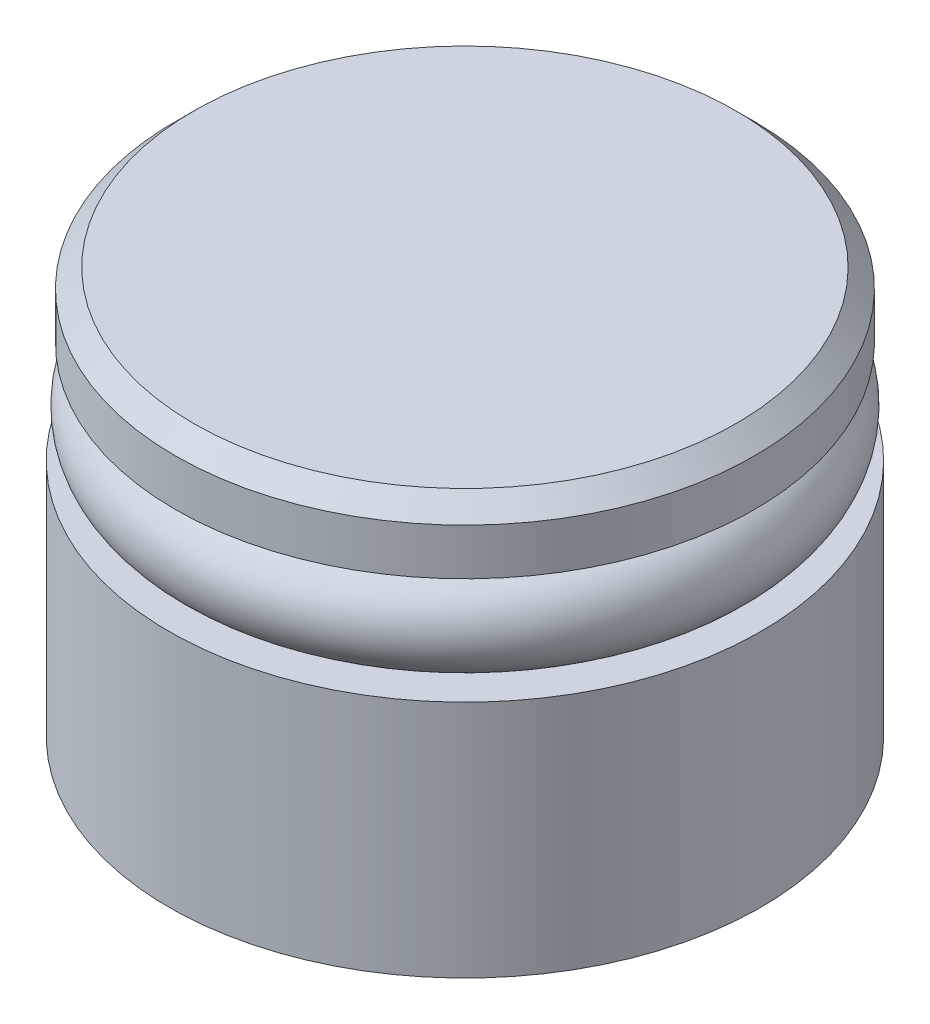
ISO-10303-21;
HEADER;
FILE_DESCRIPTION(('STEP AP214'),'2;1');
FILE_NAME('part.step','',(''),(''),'','','');
FILE_SCHEMA(('AUTOMOTIVE_DESIGN { 1 0 10303 214 1 1 1 1 }'));
ENDSEC;
DATA;
#1=APPLICATION_CONTEXT('core data for automotive mechanical design processes');
#2=APPLICATION_PROTOCOL_DEFINITION('international standard','automotive_design',2000,#1);
#3=PRODUCT_CONTEXT('',#1,'mechanical');
#4=PRODUCT('Part','Part','',(#3));
#5=PRODUCT_RELATED_PRODUCT_CATEGORY('part','',(#4));
#6=PRODUCT_DEFINITION_FORMATION('','',#4);
#7=PRODUCT_DEFINITION_CONTEXT('part definition',#1,'design');
#8=PRODUCT_DEFINITION('design','',#6,#7);
#9=PRODUCT_DEFINITION_SHAPE('','',#8);
#10=(LENGTH_UNIT() NAMED_UNIT(*) SI_UNIT(.MILLI.,.METRE.));
#11=(NAMED_UNIT(*) PLANE_ANGLE_UNIT() SI_UNIT($,.RADIAN.));
#12=(NAMED_UNIT(*) SI_UNIT($,.STERADIAN.) SOLID_ANGLE_UNIT());
#13=UNCERTAINTY_MEASURE_WITH_UNIT(LENGTH_MEASURE(1.E-05),#10,'distance_accuracy_value','');
#14=(GEOMETRIC_REPRESENTATION_CONTEXT(3) GLOBAL_UNCERTAINTY_ASSIGNED_CONTEXT((#13)) GLOBAL_UNIT_ASSIGNED_CONTEXT((#10,
#11,#12)) REPRESENTATION_CONTEXT('',''));
#15=CARTESIAN_POINT('',(0.,0.,0.));
#16=DIRECTION('',(0.,0.,1.));
#17=DIRECTION('',(1.,0.,0.));
#18=AXIS2_PLACEMENT_3D('',#15,#16,#17);
#19=CARTESIAN_POINT('',(0.,0.,0.));
#20=DIRECTION('',(0.,-1.,0.));
#21=DIRECTION('',(0.,0.,-1.));
#22=AXIS2_PLACEMENT_3D('',#19,#20,#21);
#23=PLANE('',#22);
#24=CARTESIAN_POINT('',(0.,0.,0.));
#25=DIRECTION('',(0.,-1.,0.));
#26=DIRECTION('',(0.,0.,-1.));
#27=AXIS2_PLACEMENT_3D('',#24,#25,#26);
#28=CIRCLE('',#27,3.2639);
#29=CARTESIAN_POINT('',(0.,0.,-3.2639));
#30=VERTEX_POINT('',#29);
#31=EDGE_CURVE('P0_E37',#30,#30,#28,.T.);
#32=ORIENTED_EDGE('',*,*,#31,.F.);
#33=EDGE_LOOP('',(#32));
#34=FACE_BOUND('',#33,.T.);
#35=CARTESIAN_POINT('',(0.,0.,0.));
#36=DIRECTION('',(0.,-1.,0.));
#37=DIRECTION('',(0.,0.,-1.));
#38=AXIS2_PLACEMENT_3D('',#35,#36,#37);
#39=CIRCLE('',#38,8.0899);
#40=CARTESIAN_POINT('',(0.,0.,-8.0899));
#41=VERTEX_POINT('',#40);
#42=EDGE_CURVE('P0_E53',#41,#41,#39,.T.);
#43=ORIENTED_EDGE('',*,*,#42,.T.);
#44=EDGE_LOOP('',(#43));
#45=FACE_BOUND('',#44,.T.);
#46=ADVANCED_FACE('P0_F16',(#34,#45),#23,.T.);
#47=CARTESIAN_POINT('',(0.,0.,0.));
#48=DIRECTION('',(0.,-1.,0.));
#49=DIRECTION('',(0.,0.,-1.));
#50=AXIS2_PLACEMENT_3D('',#47,#48,#49);
#51=CYLINDRICAL_SURFACE('',#50,8.0899);
#52=CARTESIAN_POINT('',(0.,6.5278,0.));
#53=DIRECTION('',(0.,-1.,0.));
#54=DIRECTION('',(0.,0.,-1.));
#55=AXIS2_PLACEMENT_3D('',#52,#53,#54);
#56=CIRCLE('',#55,8.0899);
#57=CARTESIAN_POINT('',(0.,6.5278,-8.0899));
#58=VERTEX_POINT('',#57);
#59=EDGE_CURVE('P0_E50',#58,#58,#56,.T.);
#60=ORIENTED_EDGE('',*,*,#59,.T.);
#61=EDGE_LOOP('',(#60));
#62=FACE_BOUND('',#61,.T.);
#63=ORIENTED_EDGE('',*,*,#42,.F.);
#64=EDGE_LOOP('',(#63));
#65=FACE_BOUND('',#64,.T.);
#66=ADVANCED_FACE('P0_F70',(#62,#65),#51,.T.);
#67=CARTESIAN_POINT('',(8.0899,6.5278,0.));
#68=DIRECTION('',(0.,1.,0.));
#69=DIRECTION('',(0.,0.,1.));
#70=AXIS2_PLACEMENT_3D('',#67,#68,#69);
#71=PLANE('',#70);
#72=CARTESIAN_POINT('',(0.,6.5278,0.));
#73=DIRECTION('',(0.,-1.,0.));
#74=DIRECTION('',(0.,0.,-1.));
#75=AXIS2_PLACEMENT_3D('',#72,#73,#74);
#76=CIRCLE('',#75,6.53415);
#77=CARTESIAN_POINT('',(0.,6.5278,-6.53415));
#78=VERTEX_POINT('',#77);
#79=EDGE_CURVE('P0_E47',#78,#78,#76,.T.);
#80=ORIENTED_EDGE('',*,*,#79,.T.);
#81=EDGE_LOOP('',(#80));
#82=FACE_BOUND('',#81,.T.);
#83=ORIENTED_EDGE('',*,*,#59,.F.);
#84=EDGE_LOOP('',(#83));
#85=FACE_BOUND('',#84,.T.);
#86=ADVANCED_FACE('P0_F75',(#82,#85),#71,.T.);
#87=CARTESIAN_POINT('',(0.,0.,0.));
#88=DIRECTION('',(0.,-1.,0.));
#89=DIRECTION('',(0.,0.,-1.));
#90=AXIS2_PLACEMENT_3D('',#87,#88,#89);
#91=CYLINDRICAL_SURFACE('',#90,6.53415);
#92=CARTESIAN_POINT('',(0.,9.3218,0.));
#93=DIRECTION('',(0.,-1.,0.));
#94=DIRECTION('',(0.,0.,-1.));
#95=AXIS2_PLACEMENT_3D('',#92,#93,#94);
#96=CIRCLE('',#95,6.53415);
#97=CARTESIAN_POINT('',(0.,9.3218,-6.53415));
#98=VERTEX_POINT('',#97);
#99=EDGE_CURVE('P0_E40',#98,#98,#96,.T.);
#100=ORIENTED_EDGE('',*,*,#99,.T.);
#101=EDGE_LOOP('',(#100));
#102=FACE_BOUND('',#101,.T.);
#103=ORIENTED_EDGE('',*,*,#79,.F.);
#104=EDGE_LOOP('',(#103));
#105=FACE_BOUND('',#104,.T.);
#106=ADVANCED_FACE('P0_F83',(#102,#105),#91,.T.);
#107=CARTESIAN_POINT('',(6.53415,9.3218,0.));
#108=DIRECTION('',(0.,-1.,0.));
#109=DIRECTION('',(0.,0.,-1.));
#110=AXIS2_PLACEMENT_3D('',#107,#108,#109);
#111=PLANE('',#110);
#112=CARTESIAN_POINT('',(0.,9.3218,0.));
#113=DIRECTION('',(0.,-1.,0.));
#114=DIRECTION('',(0.,0.,-1.));
#115=AXIS2_PLACEMENT_3D('',#112,#113,#114);
#116=CIRCLE('',#115,7.9121);
#117=CARTESIAN_POINT('',(0.,9.3218,-7.9121));
#118=VERTEX_POINT('',#117);
#119=EDGE_CURVE('P0_E36',#118,#118,#116,.T.);
#120=ORIENTED_EDGE('',*,*,#119,.T.);
#121=EDGE_LOOP('',(#120));
#122=FACE_BOUND('',#121,.T.);
#123=ORIENTED_EDGE('',*,*,#99,.F.);
#124=EDGE_LOOP('',(#123));
#125=FACE_BOUND('',#124,.T.);
#126=ADVANCED_FACE('P0_F87',(#122,#125),#111,.T.);
#127=CARTESIAN_POINT('',(0.,0.,0.));
#128=DIRECTION('',(0.,-1.,0.));
#129=DIRECTION('',(0.,0.,-1.));
#130=AXIS2_PLACEMENT_3D('',#127,#128,#129);
#131=CYLINDRICAL_SURFACE('',#130,7.9121);
#132=CARTESIAN_POINT('',(0.,10.5918,0.));
#133=DIRECTION('',(0.,1.,0.));
#134=DIRECTION('',(0.,0.,1.));
#135=AXIS2_PLACEMENT_3D('',#132,#133,#134);
#136=CIRCLE('',#135,7.9121);
#137=CARTESIAN_POINT('',(0.,10.5918,7.9121));
#138=VERTEX_POINT('',#137);
#139=EDGE_CURVE('P0_E23',#138,#138,#136,.F.);
#140=ORIENTED_EDGE('',*,*,#139,.T.);
#141=EDGE_LOOP('',(#140));
#142=FACE_BOUND('',#141,.T.);
#143=ORIENTED_EDGE('',*,*,#119,.F.);
#144=EDGE_LOOP('',(#143));
#145=FACE_BOUND('',#144,.T.);
#146=ADVANCED_FACE('P0_F58',(#142,#145),#131,.T.);
#147=CARTESIAN_POINT('',(7.9121,11.0998,0.));
#148=DIRECTION('',(0.,1.,0.));
#149=DIRECTION('',(0.,0.,1.));
#150=AXIS2_PLACEMENT_3D('',#147,#148,#149);
#151=PLANE('',#150);
#152=CARTESIAN_POINT('',(0.,11.0998,0.));
#153=DIRECTION('',(0.,1.,0.));
#154=DIRECTION('',(0.,0.,1.));
#155=AXIS2_PLACEMENT_3D('',#152,#153,#154);
#156=CIRCLE('',#155,7.4041);
#157=CARTESIAN_POINT('',(0.,11.0998,7.4041));
#158=VERTEX_POINT('',#157);
#159=EDGE_CURVE('P0_E11',#158,#158,#156,.T.);
#160=ORIENTED_EDGE('',*,*,#159,.T.);
#161=EDGE_LOOP('',(#160));
#162=FACE_BOUND('',#161,.T.);
#163=ADVANCED_FACE('P0_F30',(#162),#151,.T.);
#164=CARTESIAN_POINT('',(0.,6.35,0.));
#165=DIRECTION('',(0.,-1.,0.));
#166=DIRECTION('',(0.,0.,-1.));
#167=AXIS2_PLACEMENT_3D('',#164,#165,#166);
#168=CONICAL_SURFACE('',#167,3.2639,1.02974425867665);
#169=CARTESIAN_POINT('',(0.,8.31114897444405,0.));
#170=VERTEX_POINT('',#169);
#171=VERTEX_LOOP('',#170);
#172=FACE_BOUND('',#171,.T.);
#173=CARTESIAN_POINT('',(0.,6.35,0.));
#174=DIRECTION('',(0.,-1.,0.));
#175=DIRECTION('',(0.,0.,-1.));
#176=AXIS2_PLACEMENT_3D('',#173,#174,#175);
#177=CIRCLE('',#176,3.2639);
#178=CARTESIAN_POINT('',(0.,6.35,-3.2639));
#179=VERTEX_POINT('',#178);
#180=EDGE_CURVE('P0_E34',#179,#179,#177,.T.);
#181=ORIENTED_EDGE('',*,*,#180,.T.);
#182=EDGE_LOOP('',(#181));
#183=FACE_BOUND('',#182,.T.);
#184=ADVANCED_FACE('P0_F26',(#172,#183),#168,.F.);
#185=CARTESIAN_POINT('',(0.,0.,0.));
#186=DIRECTION('',(0.,-1.,0.));
#187=DIRECTION('',(0.,0.,-1.));
#188=AXIS2_PLACEMENT_3D('',#185,#186,#187);
#189=CYLINDRICAL_SURFACE('',#188,3.2639);
#190=ORIENTED_EDGE('',*,*,#180,.F.);
#191=EDGE_LOOP('',(#190));
#192=FACE_BOUND('',#191,.T.);
#193=ORIENTED_EDGE('',*,*,#31,.T.);
#194=EDGE_LOOP('',(#193));
#195=FACE_BOUND('',#194,.T.);
#196=ADVANCED_FACE('P0_F29',(#192,#195),#189,.F.);
#197=CARTESIAN_POINT('',(0.,10.5918,0.));
#198=DIRECTION('',(0.,-1.,0.));
#199=DIRECTION('',(0.,0.,-1.));
#200=AXIS2_PLACEMENT_3D('',#197,#198,#199);
#201=CONICAL_SURFACE('',#200,7.9121,0.78539816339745);
#202=ORIENTED_EDGE('',*,*,#159,.F.);
#203=EDGE_LOOP('',(#202));
#204=FACE_BOUND('',#203,.T.);
#205=ORIENTED_EDGE('',*,*,#139,.F.);
#206=EDGE_LOOP('',(#205));
#207=FACE_BOUND('',#206,.T.);
#208=ADVANCED_FACE('P0_F18',(#204,#207),#201,.T.);
#209=CLOSED_SHELL('',(#46,#66,#86,#106,#126,#146,#163,#184,#196,#208));
#210=MANIFOLD_SOLID_BREP('P0_B1',#209);
#211=CARTESIAN_POINT('',(0.,7.8359,0.));
#212=DIRECTION('',(0.,-1.,0.));
#213=DIRECTION('',(0.,0.,-1.));
#214=AXIS2_PLACEMENT_3D('',#211,#212,#213);
#215=TOROIDAL_SURFACE('',#214,6.6929,1.3081);
#216=CARTESIAN_POINT('',(0.,7.8359,-8.001));
#217=VERTEX_POINT('',#216);
#218=VERTEX_LOOP('',#217);
#219=FACE_BOUND('',#218,.T.);
#220=ADVANCED_FACE('P1_F12',(#219),#215,.T.);
#221=CLOSED_SHELL('',(#220));
#222=MANIFOLD_SOLID_BREP('P1_B1',#221);
#223=ADVANCED_BREP_SHAPE_REPRESENTATION('',(#18,#210,#222),#14);
#224=SHAPE_DEFINITION_REPRESENTATION(#9,#223);
ENDSEC;
END-ISO-10303-21;
